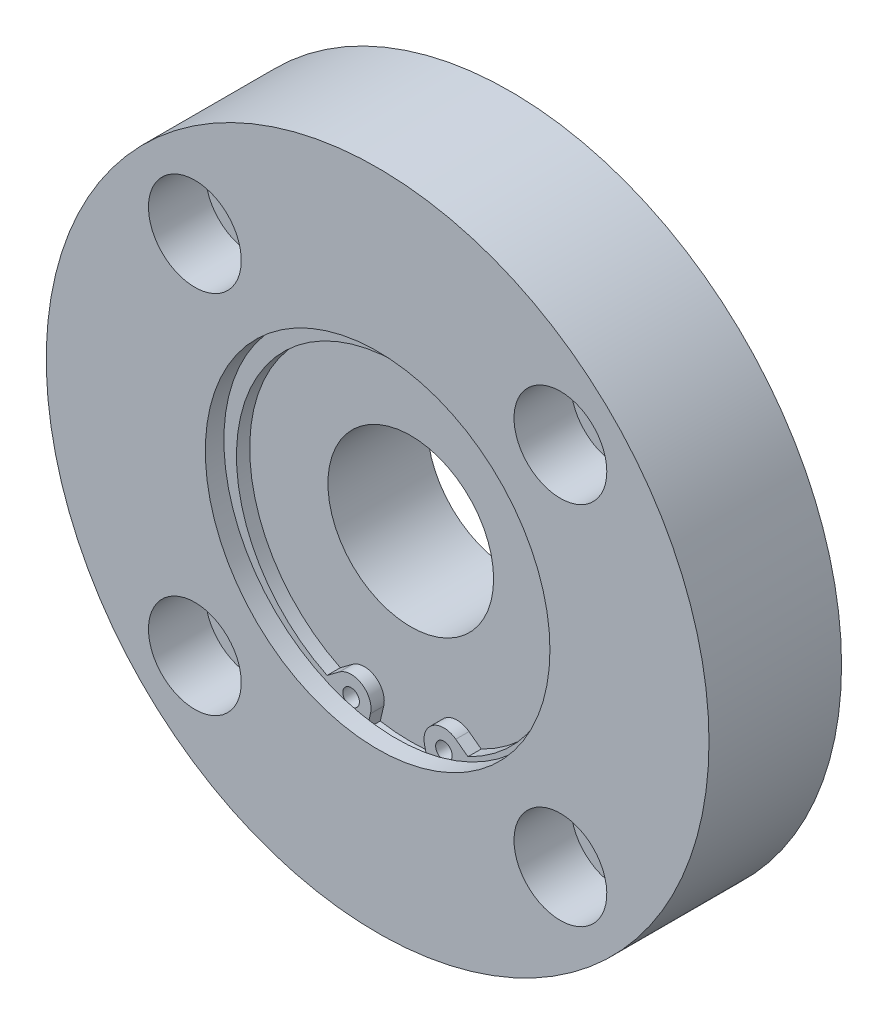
ISO-10303-21;
HEADER;
FILE_DESCRIPTION(('STEP AP214'),'2;1');
FILE_NAME('part.step','',(''),(''),'','','');
FILE_SCHEMA(('AUTOMOTIVE_DESIGN { 1 0 10303 214 1 1 1 1 }'));
ENDSEC;
DATA;
#1=APPLICATION_CONTEXT('core data for automotive mechanical design processes');
#2=APPLICATION_PROTOCOL_DEFINITION('international standard','automotive_design',2000,#1);
#3=PRODUCT_CONTEXT('',#1,'mechanical');
#4=PRODUCT('Part','Part','',(#3));
#5=PRODUCT_RELATED_PRODUCT_CATEGORY('part','',(#4));
#6=PRODUCT_DEFINITION_FORMATION('','',#4);
#7=PRODUCT_DEFINITION_CONTEXT('part definition',#1,'design');
#8=PRODUCT_DEFINITION('design','',#6,#7);
#9=PRODUCT_DEFINITION_SHAPE('','',#8);
#10=(LENGTH_UNIT() NAMED_UNIT(*) SI_UNIT(.MILLI.,.METRE.));
#11=(NAMED_UNIT(*) PLANE_ANGLE_UNIT() SI_UNIT($,.RADIAN.));
#12=(NAMED_UNIT(*) SI_UNIT($,.STERADIAN.) SOLID_ANGLE_UNIT());
#13=UNCERTAINTY_MEASURE_WITH_UNIT(LENGTH_MEASURE(1.E-05),#10,'distance_accuracy_value','');
#14=(GEOMETRIC_REPRESENTATION_CONTEXT(3) GLOBAL_UNCERTAINTY_ASSIGNED_CONTEXT((#13)) GLOBAL_UNIT_ASSIGNED_CONTEXT((#10,
#11,#12)) REPRESENTATION_CONTEXT('',''));
#15=CARTESIAN_POINT('',(0.,0.,0.));
#16=DIRECTION('',(0.,0.,1.));
#17=DIRECTION('',(1.,0.,0.));
#18=AXIS2_PLACEMENT_3D('',#15,#16,#17);
#19=CARTESIAN_POINT('',(0.,0.,15.));
#20=DIRECTION('',(0.,0.,1.));
#21=DIRECTION('',(1.,0.,0.));
#22=AXIS2_PLACEMENT_3D('',#19,#20,#21);
#23=PLANE('',#22);
#24=CARTESIAN_POINT('',(7.,-24.1958547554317,15.));
#25=DIRECTION('',(0.,0.,1.));
#26=DIRECTION('',(1.,0.,0.));
#27=AXIS2_PLACEMENT_3D('',#24,#25,#26);
#28=CIRCLE('',#27,1.25);
#29=CARTESIAN_POINT('',(8.25,-24.1958547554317,15.));
#30=VERTEX_POINT('',#29);
#31=EDGE_CURVE('E136',#30,#30,#28,.T.);
#32=ORIENTED_EDGE('',*,*,#31,.T.);
#33=EDGE_LOOP('',(#32));
#34=FACE_BOUND('',#33,.T.);
#35=ADVANCED_FACE('F14',(#34),#23,.T.);
#36=CARTESIAN_POINT('',(-7.,-24.1958547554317,15.));
#37=DIRECTION('',(0.,0.,-1.));
#38=DIRECTION('',(1.,0.,0.));
#39=AXIS2_PLACEMENT_3D('',#36,#37,#38);
#40=CIRCLE('',#39,1.25);
#41=CARTESIAN_POINT('',(-5.75,-24.1958547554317,15.));
#42=VERTEX_POINT('',#41);
#43=EDGE_CURVE('E162',#42,#42,#40,.T.);
#44=ORIENTED_EDGE('',*,*,#43,.F.);
#45=EDGE_LOOP('',(#44));
#46=FACE_BOUND('',#45,.T.);
#47=ADVANCED_FACE('F275',(#46),#23,.T.);
#48=CARTESIAN_POINT('',(27.5771644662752,27.5771644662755,0.));
#49=DIRECTION('',(0.,0.,1.));
#50=DIRECTION('',(1.,0.,0.));
#51=AXIS2_PLACEMENT_3D('',#48,#49,#50);
#52=CYLINDRICAL_SURFACE('',#51,5.);
#53=CARTESIAN_POINT('',(27.5771644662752,27.5771644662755,0.));
#54=DIRECTION('',(0.,0.,1.));
#55=DIRECTION('',(1.,0.,0.));
#56=AXIS2_PLACEMENT_3D('',#53,#54,#55);
#57=CIRCLE('',#56,5.);
#58=CARTESIAN_POINT('',(32.5771644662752,27.5771644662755,0.));
#59=VERTEX_POINT('',#58);
#60=EDGE_CURVE('E228',#59,#59,#57,.T.);
#61=ORIENTED_EDGE('',*,*,#60,.F.);
#62=EDGE_LOOP('',(#61));
#63=FACE_BOUND('',#62,.T.);
#64=CARTESIAN_POINT('',(27.5771644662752,27.5771644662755,11.4));
#65=DIRECTION('',(0.,0.,1.));
#66=DIRECTION('',(1.,0.,0.));
#67=AXIS2_PLACEMENT_3D('',#64,#65,#66);
#68=CIRCLE('',#67,5.);
#69=CARTESIAN_POINT('',(32.5771644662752,27.5771644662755,11.4));
#70=VERTEX_POINT('',#69);
#71=EDGE_CURVE('E227',#70,#70,#68,.F.);
#72=ORIENTED_EDGE('',*,*,#71,.F.);
#73=EDGE_LOOP('',(#72));
#74=FACE_BOUND('',#73,.T.);
#75=ADVANCED_FACE('F282',(#63,#74),#52,.F.);
#76=CARTESIAN_POINT('',(27.5771644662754,-27.5771644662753,0.));
#77=DIRECTION('',(0.,0.,1.));
#78=DIRECTION('',(1.,0.,0.));
#79=AXIS2_PLACEMENT_3D('',#76,#77,#78);
#80=CYLINDRICAL_SURFACE('',#79,5.);
#81=CARTESIAN_POINT('',(27.5771644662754,-27.5771644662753,0.));
#82=DIRECTION('',(0.,0.,1.));
#83=DIRECTION('',(0.,-1.,0.));
#84=AXIS2_PLACEMENT_3D('',#81,#82,#83);
#85=CIRCLE('',#84,5.);
#86=CARTESIAN_POINT('',(27.5771644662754,-32.5771644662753,0.));
#87=VERTEX_POINT('',#86);
#88=EDGE_CURVE('E218',#87,#87,#85,.T.);
#89=ORIENTED_EDGE('',*,*,#88,.F.);
#90=EDGE_LOOP('',(#89));
#91=FACE_BOUND('',#90,.T.);
#92=CARTESIAN_POINT('',(27.5771644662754,-27.5771644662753,11.4));
#93=DIRECTION('',(0.,0.,1.));
#94=DIRECTION('',(1.,0.,0.));
#95=AXIS2_PLACEMENT_3D('',#92,#93,#94);
#96=CIRCLE('',#95,5.);
#97=CARTESIAN_POINT('',(32.5771644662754,-27.5771644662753,11.4));
#98=VERTEX_POINT('',#97);
#99=EDGE_CURVE('E211',#98,#98,#96,.F.);
#100=ORIENTED_EDGE('',*,*,#99,.F.);
#101=EDGE_LOOP('',(#100));
#102=FACE_BOUND('',#101,.T.);
#103=ADVANCED_FACE('F635',(#91,#102),#80,.F.);
#104=CARTESIAN_POINT('',(-27.5771644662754,-27.5771644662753,0.));
#105=DIRECTION('',(0.,0.,1.));
#106=DIRECTION('',(1.,0.,0.));
#107=AXIS2_PLACEMENT_3D('',#104,#105,#106);
#108=CYLINDRICAL_SURFACE('',#107,5.);
#109=CARTESIAN_POINT('',(-27.5771644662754,-27.5771644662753,0.));
#110=DIRECTION('',(0.,0.,1.));
#111=DIRECTION('',(-1.,0.,0.));
#112=AXIS2_PLACEMENT_3D('',#109,#110,#111);
#113=CIRCLE('',#112,5.);
#114=CARTESIAN_POINT('',(-32.5771644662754,-27.5771644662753,0.));
#115=VERTEX_POINT('',#114);
#116=EDGE_CURVE('E215',#115,#115,#113,.T.);
#117=ORIENTED_EDGE('',*,*,#116,.F.);
#118=EDGE_LOOP('',(#117));
#119=FACE_BOUND('',#118,.T.);
#120=CARTESIAN_POINT('',(-27.5771644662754,-27.5771644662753,11.4));
#121=DIRECTION('',(0.,0.,1.));
#122=DIRECTION('',(1.,0.,0.));
#123=AXIS2_PLACEMENT_3D('',#120,#121,#122);
#124=CIRCLE('',#123,5.);
#125=CARTESIAN_POINT('',(-22.5771644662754,-27.5771644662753,11.4));
#126=VERTEX_POINT('',#125);
#127=EDGE_CURVE('E204',#126,#126,#124,.F.);
#128=ORIENTED_EDGE('',*,*,#127,.F.);
#129=EDGE_LOOP('',(#128));
#130=FACE_BOUND('',#129,.T.);
#131=ADVANCED_FACE('F625',(#119,#130),#108,.F.);
#132=CARTESIAN_POINT('',(-27.5771644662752,27.5771644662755,0.));
#133=DIRECTION('',(0.,0.,1.));
#134=DIRECTION('',(1.,0.,0.));
#135=AXIS2_PLACEMENT_3D('',#132,#133,#134);
#136=CYLINDRICAL_SURFACE('',#135,5.);
#137=CARTESIAN_POINT('',(-27.5771644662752,27.5771644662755,0.));
#138=DIRECTION('',(0.,0.,1.));
#139=DIRECTION('',(0.,1.,0.));
#140=AXIS2_PLACEMENT_3D('',#137,#138,#139);
#141=CIRCLE('',#140,5.);
#142=CARTESIAN_POINT('',(-27.5771644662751,32.5771644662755,0.));
#143=VERTEX_POINT('',#142);
#144=EDGE_CURVE('E212',#143,#143,#141,.T.);
#145=ORIENTED_EDGE('',*,*,#144,.F.);
#146=EDGE_LOOP('',(#145));
#147=FACE_BOUND('',#146,.T.);
#148=CARTESIAN_POINT('',(-27.5771644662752,27.5771644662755,11.4));
#149=DIRECTION('',(0.,0.,1.));
#150=DIRECTION('',(1.,0.,0.));
#151=AXIS2_PLACEMENT_3D('',#148,#149,#150);
#152=CIRCLE('',#151,5.);
#153=CARTESIAN_POINT('',(-22.5771644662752,27.5771644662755,11.4));
#154=VERTEX_POINT('',#153);
#155=EDGE_CURVE('E197',#154,#154,#152,.F.);
#156=ORIENTED_EDGE('',*,*,#155,.F.);
#157=EDGE_LOOP('',(#156));
#158=FACE_BOUND('',#157,.T.);
#159=ADVANCED_FACE('F616',(#147,#158),#136,.F.);
#160=CARTESIAN_POINT('',(0.,0.,0.));
#161=DIRECTION('',(0.,0.,1.));
#162=DIRECTION('',(1.,0.,0.));
#163=AXIS2_PLACEMENT_3D('',#160,#161,#162);
#164=PLANE('',#163);
#165=ORIENTED_EDGE('',*,*,#144,.T.);
#166=EDGE_LOOP('',(#165));
#167=FACE_BOUND('',#166,.T.);
#168=ORIENTED_EDGE('',*,*,#116,.T.);
#169=EDGE_LOOP('',(#168));
#170=FACE_BOUND('',#169,.T.);
#171=ORIENTED_EDGE('',*,*,#88,.T.);
#172=EDGE_LOOP('',(#171));
#173=FACE_BOUND('',#172,.T.);
#174=ORIENTED_EDGE('',*,*,#60,.T.);
#175=EDGE_LOOP('',(#174));
#176=FACE_BOUND('',#175,.T.);
#177=CARTESIAN_POINT('',(0.,0.,0.));
#178=DIRECTION('',(0.,0.,1.));
#179=DIRECTION('',(1.,0.,0.));
#180=AXIS2_PLACEMENT_3D('',#177,#178,#179);
#181=CIRCLE('',#180,50.);
#182=CARTESIAN_POINT('',(50.,0.,0.));
#183=VERTEX_POINT('',#182);
#184=EDGE_CURVE('E234',#183,#183,#181,.T.);
#185=ORIENTED_EDGE('',*,*,#184,.F.);
#186=EDGE_LOOP('',(#185));
#187=FACE_BOUND('',#186,.T.);
#188=CARTESIAN_POINT('',(0.,0.,0.));
#189=DIRECTION('',(0.,0.,-1.));
#190=DIRECTION('',(-1.,0.,0.));
#191=AXIS2_PLACEMENT_3D('',#188,#189,#190);
#192=CIRCLE('',#191,30.);
#193=CARTESIAN_POINT('',(-30.,0.,0.));
#194=VERTEX_POINT('',#193);
#195=EDGE_CURVE('E180',#194,#194,#192,.T.);
#196=ORIENTED_EDGE('',*,*,#195,.F.);
#197=EDGE_LOOP('',(#196));
#198=FACE_BOUND('',#197,.T.);
#199=ADVANCED_FACE('F271',(#167,#170,#173,#176,#187,#198),#164,.F.);
#200=CARTESIAN_POINT('',(27.5771644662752,27.5771644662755,11.4));
#201=DIRECTION('',(0.,0.,1.));
#202=DIRECTION('',(1.,0.,0.));
#203=AXIS2_PLACEMENT_3D('',#200,#201,#202);
#204=PLANE('',#203);
#205=CARTESIAN_POINT('',(27.5771644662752,27.5771644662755,11.4));
#206=DIRECTION('',(0.,0.,1.));
#207=DIRECTION('',(1.,0.,0.));
#208=AXIS2_PLACEMENT_3D('',#205,#206,#207);
#209=CIRCLE('',#208,7.);
#210=CARTESIAN_POINT('',(34.5771644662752,27.5771644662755,11.4));
#211=VERTEX_POINT('',#210);
#212=EDGE_CURVE('E224',#211,#211,#209,.T.);
#213=ORIENTED_EDGE('',*,*,#212,.T.);
#214=EDGE_LOOP('',(#213));
#215=FACE_BOUND('',#214,.T.);
#216=ORIENTED_EDGE('',*,*,#71,.T.);
#217=EDGE_LOOP('',(#216));
#218=FACE_BOUND('',#217,.T.);
#219=ADVANCED_FACE('F597',(#215,#218),#204,.T.);
#220=CARTESIAN_POINT('',(27.5771644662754,-27.5771644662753,11.4));
#221=DIRECTION('',(0.,0.,1.));
#222=DIRECTION('',(0.,-1.,0.));
#223=AXIS2_PLACEMENT_3D('',#220,#221,#222);
#224=PLANE('',#223);
#225=CARTESIAN_POINT('',(27.5771644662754,-27.5771644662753,11.4));
#226=DIRECTION('',(0.,0.,1.));
#227=DIRECTION('',(0.,-1.,0.));
#228=AXIS2_PLACEMENT_3D('',#225,#226,#227);
#229=CIRCLE('',#228,7.);
#230=CARTESIAN_POINT('',(27.5771644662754,-34.5771644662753,11.4));
#231=VERTEX_POINT('',#230);
#232=EDGE_CURVE('E208',#231,#231,#229,.T.);
#233=ORIENTED_EDGE('',*,*,#232,.T.);
#234=EDGE_LOOP('',(#233));
#235=FACE_BOUND('',#234,.T.);
#236=ORIENTED_EDGE('',*,*,#99,.T.);
#237=EDGE_LOOP('',(#236));
#238=FACE_BOUND('',#237,.T.);
#239=ADVANCED_FACE('F587',(#235,#238),#224,.T.);
#240=CARTESIAN_POINT('',(-27.5771644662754,-27.5771644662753,11.4));
#241=DIRECTION('',(0.,0.,1.));
#242=DIRECTION('',(-1.,0.,0.));
#243=AXIS2_PLACEMENT_3D('',#240,#241,#242);
#244=PLANE('',#243);
#245=CARTESIAN_POINT('',(-27.5771644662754,-27.5771644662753,11.4));
#246=DIRECTION('',(0.,0.,1.));
#247=DIRECTION('',(-1.,0.,0.));
#248=AXIS2_PLACEMENT_3D('',#245,#246,#247);
#249=CIRCLE('',#248,7.);
#250=CARTESIAN_POINT('',(-34.5771644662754,-27.5771644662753,11.4));
#251=VERTEX_POINT('',#250);
#252=EDGE_CURVE('E201',#251,#251,#249,.T.);
#253=ORIENTED_EDGE('',*,*,#252,.T.);
#254=EDGE_LOOP('',(#253));
#255=FACE_BOUND('',#254,.T.);
#256=ORIENTED_EDGE('',*,*,#127,.T.);
#257=EDGE_LOOP('',(#256));
#258=FACE_BOUND('',#257,.T.);
#259=ADVANCED_FACE('F577',(#255,#258),#244,.T.);
#260=CARTESIAN_POINT('',(-27.5771644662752,27.5771644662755,11.4));
#261=DIRECTION('',(0.,0.,1.));
#262=DIRECTION('',(0.,1.,0.));
#263=AXIS2_PLACEMENT_3D('',#260,#261,#262);
#264=PLANE('',#263);
#265=CARTESIAN_POINT('',(-27.5771644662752,27.5771644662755,11.4));
#266=DIRECTION('',(0.,0.,1.));
#267=DIRECTION('',(0.,1.,0.));
#268=AXIS2_PLACEMENT_3D('',#265,#266,#267);
#269=CIRCLE('',#268,7.);
#270=CARTESIAN_POINT('',(-27.5771644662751,34.5771644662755,11.4));
#271=VERTEX_POINT('',#270);
#272=EDGE_CURVE('E194',#271,#271,#269,.T.);
#273=ORIENTED_EDGE('',*,*,#272,.T.);
#274=EDGE_LOOP('',(#273));
#275=FACE_BOUND('',#274,.T.);
#276=ORIENTED_EDGE('',*,*,#155,.T.);
#277=EDGE_LOOP('',(#276));
#278=FACE_BOUND('',#277,.T.);
#279=ADVANCED_FACE('F568',(#275,#278),#264,.T.);
#280=CARTESIAN_POINT('',(0.,0.,-5.));
#281=DIRECTION('',(0.,0.,1.));
#282=DIRECTION('',(1.,0.,0.));
#283=AXIS2_PLACEMENT_3D('',#280,#281,#282);
#284=CYLINDRICAL_SURFACE('',#283,30.);
#285=CARTESIAN_POINT('',(0.,0.,-5.));
#286=DIRECTION('',(0.,0.,-1.));
#287=DIRECTION('',(-1.,0.,0.));
#288=AXIS2_PLACEMENT_3D('',#285,#286,#287);
#289=CIRCLE('',#288,30.);
#290=CARTESIAN_POINT('',(-30.,0.,-5.));
#291=VERTEX_POINT('',#290);
#292=EDGE_CURVE('E179',#291,#291,#289,.T.);
#293=ORIENTED_EDGE('',*,*,#292,.F.);
#294=EDGE_LOOP('',(#293));
#295=FACE_BOUND('',#294,.T.);
#296=ORIENTED_EDGE('',*,*,#195,.T.);
#297=EDGE_LOOP('',(#296));
#298=FACE_BOUND('',#297,.T.);
#299=ADVANCED_FACE('F559',(#295,#298),#284,.T.);
#300=CARTESIAN_POINT('',(0.,0.,20.));
#301=DIRECTION('',(0.,0.,-1.));
#302=DIRECTION('',(-1.,0.,0.));
#303=AXIS2_PLACEMENT_3D('',#300,#301,#302);
#304=CYLINDRICAL_SURFACE('',#303,50.);
#305=CARTESIAN_POINT('',(0.,0.,20.));
#306=DIRECTION('',(0.,0.,1.));
#307=DIRECTION('',(1.,0.,0.));
#308=AXIS2_PLACEMENT_3D('',#305,#306,#307);
#309=CIRCLE('',#308,50.);
#310=CARTESIAN_POINT('',(50.,0.,20.));
#311=VERTEX_POINT('',#310);
#312=EDGE_CURVE('E184',#311,#311,#309,.T.);
#313=ORIENTED_EDGE('',*,*,#312,.F.);
#314=EDGE_LOOP('',(#313));
#315=FACE_BOUND('',#314,.T.);
#316=ORIENTED_EDGE('',*,*,#184,.T.);
#317=EDGE_LOOP('',(#316));
#318=FACE_BOUND('',#317,.T.);
#319=ADVANCED_FACE('F16',(#315,#318),#304,.T.);
#320=CARTESIAN_POINT('',(27.5771644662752,27.5771644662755,11.4));
#321=DIRECTION('',(0.,0.,1.));
#322=DIRECTION('',(1.,0.,0.));
#323=AXIS2_PLACEMENT_3D('',#320,#321,#322);
#324=CYLINDRICAL_SURFACE('',#323,7.);
#325=ORIENTED_EDGE('',*,*,#212,.F.);
#326=EDGE_LOOP('',(#325));
#327=FACE_BOUND('',#326,.T.);
#328=CARTESIAN_POINT('',(27.5771644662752,27.5771644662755,20.));
#329=DIRECTION('',(0.,0.,1.));
#330=DIRECTION('',(1.,0.,0.));
#331=AXIS2_PLACEMENT_3D('',#328,#329,#330);
#332=CIRCLE('',#331,7.);
#333=CARTESIAN_POINT('',(34.5771644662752,27.5771644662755,20.));
#334=VERTEX_POINT('',#333);
#335=EDGE_CURVE('E221',#334,#334,#332,.T.);
#336=ORIENTED_EDGE('',*,*,#335,.T.);
#337=EDGE_LOOP('',(#336));
#338=FACE_BOUND('',#337,.T.);
#339=ADVANCED_FACE('F540',(#327,#338),#324,.F.);
#340=CARTESIAN_POINT('',(27.5771644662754,-27.5771644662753,11.4));
#341=DIRECTION('',(0.,0.,1.));
#342=DIRECTION('',(1.,0.,0.));
#343=AXIS2_PLACEMENT_3D('',#340,#341,#342);
#344=CYLINDRICAL_SURFACE('',#343,7.);
#345=ORIENTED_EDGE('',*,*,#232,.F.);
#346=EDGE_LOOP('',(#345));
#347=FACE_BOUND('',#346,.T.);
#348=CARTESIAN_POINT('',(27.5771644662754,-27.5771644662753,20.));
#349=DIRECTION('',(0.,0.,1.));
#350=DIRECTION('',(0.,-1.,0.));
#351=AXIS2_PLACEMENT_3D('',#348,#349,#350);
#352=CIRCLE('',#351,7.);
#353=CARTESIAN_POINT('',(27.5771644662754,-34.5771644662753,20.));
#354=VERTEX_POINT('',#353);
#355=EDGE_CURVE('E205',#354,#354,#352,.T.);
#356=ORIENTED_EDGE('',*,*,#355,.T.);
#357=EDGE_LOOP('',(#356));
#358=FACE_BOUND('',#357,.T.);
#359=ADVANCED_FACE('F530',(#347,#358),#344,.F.);
#360=CARTESIAN_POINT('',(-27.5771644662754,-27.5771644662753,11.4));
#361=DIRECTION('',(0.,0.,1.));
#362=DIRECTION('',(1.,0.,0.));
#363=AXIS2_PLACEMENT_3D('',#360,#361,#362);
#364=CYLINDRICAL_SURFACE('',#363,7.);
#365=ORIENTED_EDGE('',*,*,#252,.F.);
#366=EDGE_LOOP('',(#365));
#367=FACE_BOUND('',#366,.T.);
#368=CARTESIAN_POINT('',(-27.5771644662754,-27.5771644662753,20.));
#369=DIRECTION('',(0.,0.,1.));
#370=DIRECTION('',(-1.,0.,0.));
#371=AXIS2_PLACEMENT_3D('',#368,#369,#370);
#372=CIRCLE('',#371,7.);
#373=CARTESIAN_POINT('',(-34.5771644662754,-27.5771644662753,20.));
#374=VERTEX_POINT('',#373);
#375=EDGE_CURVE('E198',#374,#374,#372,.T.);
#376=ORIENTED_EDGE('',*,*,#375,.T.);
#377=EDGE_LOOP('',(#376));
#378=FACE_BOUND('',#377,.T.);
#379=ADVANCED_FACE('F520',(#367,#378),#364,.F.);
#380=CARTESIAN_POINT('',(-27.5771644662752,27.5771644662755,11.4));
#381=DIRECTION('',(0.,0.,1.));
#382=DIRECTION('',(1.,0.,0.));
#383=AXIS2_PLACEMENT_3D('',#380,#381,#382);
#384=CYLINDRICAL_SURFACE('',#383,7.);
#385=ORIENTED_EDGE('',*,*,#272,.F.);
#386=EDGE_LOOP('',(#385));
#387=FACE_BOUND('',#386,.T.);
#388=CARTESIAN_POINT('',(-27.5771644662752,27.5771644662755,20.));
#389=DIRECTION('',(0.,0.,1.));
#390=DIRECTION('',(0.,1.,0.));
#391=AXIS2_PLACEMENT_3D('',#388,#389,#390);
#392=CIRCLE('',#391,7.);
#393=CARTESIAN_POINT('',(-27.5771644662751,34.5771644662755,20.));
#394=VERTEX_POINT('',#393);
#395=EDGE_CURVE('E191',#394,#394,#392,.T.);
#396=ORIENTED_EDGE('',*,*,#395,.T.);
#397=EDGE_LOOP('',(#396));
#398=FACE_BOUND('',#397,.T.);
#399=ADVANCED_FACE('F510',(#387,#398),#384,.F.);
#400=CARTESIAN_POINT('',(0.,0.,-5.));
#401=DIRECTION('',(0.,0.,-1.));
#402=DIRECTION('',(-1.,0.,0.));
#403=AXIS2_PLACEMENT_3D('',#400,#401,#402);
#404=PLANE('',#403);
#405=ORIENTED_EDGE('',*,*,#292,.T.);
#406=EDGE_LOOP('',(#405));
#407=FACE_BOUND('',#406,.T.);
#408=CARTESIAN_POINT('',(0.,0.,-5.));
#409=DIRECTION('',(0.,0.,-1.));
#410=DIRECTION('',(-1.,0.,0.));
#411=AXIS2_PLACEMENT_3D('',#408,#409,#410);
#412=CIRCLE('',#411,22.5);
#413=CARTESIAN_POINT('',(-22.5,0.,-5.));
#414=VERTEX_POINT('',#413);
#415=EDGE_CURVE('E176',#414,#414,#412,.T.);
#416=ORIENTED_EDGE('',*,*,#415,.F.);
#417=EDGE_LOOP('',(#416));
#418=FACE_BOUND('',#417,.T.);
#419=ADVANCED_FACE('F501',(#407,#418),#404,.T.);
#420=CARTESIAN_POINT('',(0.,0.,20.));
#421=DIRECTION('',(0.,0.,1.));
#422=DIRECTION('',(1.,0.,0.));
#423=AXIS2_PLACEMENT_3D('',#420,#421,#422);
#424=PLANE('',#423);
#425=CARTESIAN_POINT('',(0.,0.,20.));
#426=DIRECTION('',(0.,0.,1.));
#427=DIRECTION('',(1.,0.,0.));
#428=AXIS2_PLACEMENT_3D('',#425,#426,#427);
#429=CIRCLE('',#428,26.);
#430=CARTESIAN_POINT('',(26.,0.,20.));
#431=VERTEX_POINT('',#430);
#432=EDGE_CURVE('E187',#431,#431,#429,.T.);
#433=ORIENTED_EDGE('',*,*,#432,.F.);
#434=EDGE_LOOP('',(#433));
#435=FACE_BOUND('',#434,.T.);
#436=ORIENTED_EDGE('',*,*,#395,.F.);
#437=EDGE_LOOP('',(#436));
#438=FACE_BOUND('',#437,.T.);
#439=ORIENTED_EDGE('',*,*,#375,.F.);
#440=EDGE_LOOP('',(#439));
#441=FACE_BOUND('',#440,.T.);
#442=ORIENTED_EDGE('',*,*,#355,.F.);
#443=EDGE_LOOP('',(#442));
#444=FACE_BOUND('',#443,.T.);
#445=ORIENTED_EDGE('',*,*,#335,.F.);
#446=EDGE_LOOP('',(#445));
#447=FACE_BOUND('',#446,.T.);
#448=ORIENTED_EDGE('',*,*,#312,.T.);
#449=EDGE_LOOP('',(#448));
#450=FACE_BOUND('',#449,.T.);
#451=ADVANCED_FACE('F491',(#435,#438,#441,#444,#447,#450),#424,.T.);
#452=CARTESIAN_POINT('',(0.,0.,-5.));
#453=DIRECTION('',(0.,0.,1.));
#454=DIRECTION('',(1.,0.,0.));
#455=AXIS2_PLACEMENT_3D('',#452,#453,#454);
#456=CYLINDRICAL_SURFACE('',#455,22.5);
#457=ORIENTED_EDGE('',*,*,#415,.T.);
#458=EDGE_LOOP('',(#457));
#459=FACE_BOUND('',#458,.T.);
#460=CARTESIAN_POINT('',(0.,0.,0.));
#461=DIRECTION('',(0.,0.,-1.));
#462=DIRECTION('',(-1.,0.,0.));
#463=AXIS2_PLACEMENT_3D('',#460,#461,#462);
#464=CIRCLE('',#463,22.5);
#465=CARTESIAN_POINT('',(-22.5,0.,0.));
#466=VERTEX_POINT('',#465);
#467=EDGE_CURVE('E173',#466,#466,#464,.T.);
#468=ORIENTED_EDGE('',*,*,#467,.F.);
#469=EDGE_LOOP('',(#468));
#470=FACE_BOUND('',#469,.T.);
#471=ADVANCED_FACE('F483',(#459,#470),#456,.F.);
#472=CARTESIAN_POINT('',(0.,0.,15.));
#473=DIRECTION('',(0.,0.,1.));
#474=DIRECTION('',(1.,0.,0.));
#475=AXIS2_PLACEMENT_3D('',#472,#473,#474);
#476=CYLINDRICAL_SURFACE('',#475,26.);
#477=CARTESIAN_POINT('',(0.,0.,17.2));
#478=DIRECTION('',(0.,0.,1.));
#479=DIRECTION('',(1.,0.,0.));
#480=AXIS2_PLACEMENT_3D('',#477,#478,#479);
#481=CIRCLE('',#480,26.);
#482=CARTESIAN_POINT('',(26.,0.,17.2));
#483=VERTEX_POINT('',#482);
#484=EDGE_CURVE('E169',#483,#483,#481,.F.);
#485=ORIENTED_EDGE('',*,*,#484,.T.);
#486=EDGE_LOOP('',(#485));
#487=FACE_BOUND('',#486,.T.);
#488=ORIENTED_EDGE('',*,*,#432,.T.);
#489=EDGE_LOOP('',(#488));
#490=FACE_BOUND('',#489,.T.);
#491=ADVANCED_FACE('F252',(#487,#490),#476,.F.);
#492=ORIENTED_EDGE('',*,*,#467,.T.);
#493=EDGE_LOOP('',(#492));
#494=FACE_BOUND('',#493,.T.);
#495=CARTESIAN_POINT('',(0.,0.,0.));
#496=DIRECTION('',(0.,0.,1.));
#497=DIRECTION('',(1.,0.,0.));
#498=AXIS2_PLACEMENT_3D('',#495,#496,#497);
#499=CIRCLE('',#498,12.5);
#500=CARTESIAN_POINT('',(12.5,0.,0.));
#501=VERTEX_POINT('',#500);
#502=EDGE_CURVE('E231',#501,#501,#499,.T.);
#503=ORIENTED_EDGE('',*,*,#502,.T.);
#504=EDGE_LOOP('',(#503));
#505=FACE_BOUND('',#504,.T.);
#506=ADVANCED_FACE('F258',(#494,#505),#164,.F.);
#507=CARTESIAN_POINT('',(0.,0.,17.2));
#508=DIRECTION('',(0.,0.,1.));
#509=DIRECTION('',(1.,0.,0.));
#510=AXIS2_PLACEMENT_3D('',#507,#508,#509);
#511=PLANE('',#510);
#512=CARTESIAN_POINT('',(0.,0.,17.2));
#513=DIRECTION('',(0.,0.,1.));
#514=DIRECTION('',(1.,0.,0.));
#515=AXIS2_PLACEMENT_3D('',#512,#513,#514);
#516=CIRCLE('',#515,27.5);
#517=CARTESIAN_POINT('',(27.5,0.,17.2));
#518=VERTEX_POINT('',#517);
#519=EDGE_CURVE('E166',#518,#518,#516,.T.);
#520=ORIENTED_EDGE('',*,*,#519,.F.);
#521=EDGE_LOOP('',(#520));
#522=FACE_BOUND('',#521,.T.);
#523=ORIENTED_EDGE('',*,*,#484,.F.);
#524=EDGE_LOOP('',(#523));
#525=FACE_BOUND('',#524,.T.);
#526=ADVANCED_FACE('F255',(#522,#525),#511,.F.);
#527=CARTESIAN_POINT('',(0.,0.,17.2));
#528=DIRECTION('',(0.,0.,-1.));
#529=DIRECTION('',(-1.,0.,0.));
#530=AXIS2_PLACEMENT_3D('',#527,#528,#529);
#531=CYLINDRICAL_SURFACE('',#530,27.5);
#532=ORIENTED_EDGE('',*,*,#519,.T.);
#533=EDGE_LOOP('',(#532));
#534=FACE_BOUND('',#533,.T.);
#535=DIRECTION('',(0.,0.,-1.));
#536=VECTOR('',#535,1.);
#537=CARTESIAN_POINT('',(4.60954752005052,-27.1109216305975,17.2));
#538=LINE('',#537,#536);
#539=CARTESIAN_POINT('',(4.60954752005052,-27.1109216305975,15.));
#540=VERTEX_POINT('',#539);
#541=CARTESIAN_POINT('',(4.60954752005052,-27.1109216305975,17.));
#542=VERTEX_POINT('',#541);
#543=EDGE_CURVE('E18',#540,#542,#538,.F.);
#544=ORIENTED_EDGE('',*,*,#543,.F.);
#545=CARTESIAN_POINT('',(0.,0.,15.));
#546=DIRECTION('',(0.,0.,1.));
#547=DIRECTION('',(1.,0.,0.));
#548=AXIS2_PLACEMENT_3D('',#545,#546,#547);
#549=CIRCLE('',#548,27.5);
#550=CARTESIAN_POINT('',(-4.60954752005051,-27.1109216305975,15.));
#551=VERTEX_POINT('',#550);
#552=EDGE_CURVE('E170',#551,#540,#549,.T.);
#553=ORIENTED_EDGE('',*,*,#552,.F.);
#554=DIRECTION('',(0.,0.,-1.));
#555=VECTOR('',#554,1.);
#556=CARTESIAN_POINT('',(-4.60954752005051,-27.1109216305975,17.2));
#557=LINE('',#556,#555);
#558=CARTESIAN_POINT('',(-4.60954752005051,-27.1109216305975,17.));
#559=VERTEX_POINT('',#558);
#560=EDGE_CURVE('E163',#559,#551,#557,.T.);
#561=ORIENTED_EDGE('',*,*,#560,.F.);
#562=CARTESIAN_POINT('',(0.,0.,17.));
#563=DIRECTION('',(0.,0.,-1.));
#564=DIRECTION('',(-1.,0.,0.));
#565=AXIS2_PLACEMENT_3D('',#562,#563,#564);
#566=CIRCLE('',#565,27.5);
#567=EDGE_CURVE('E9',#542,#559,#566,.F.);
#568=ORIENTED_EDGE('',*,*,#567,.F.);
#569=EDGE_LOOP('',(#544,#553,#561,#568));
#570=FACE_BOUND('',#569,.T.);
#571=ADVANCED_FACE('F257',(#534,#570),#531,.F.);
#572=CARTESIAN_POINT('',(0.,0.,20.));
#573=DIRECTION('',(0.,0.,-1.));
#574=DIRECTION('',(-1.,0.,0.));
#575=AXIS2_PLACEMENT_3D('',#572,#573,#574);
#576=CYLINDRICAL_SURFACE('',#575,12.5);
#577=ORIENTED_EDGE('',*,*,#502,.F.);
#578=EDGE_LOOP('',(#577));
#579=FACE_BOUND('',#578,.T.);
#580=CARTESIAN_POINT('',(0.,0.,15.));
#581=DIRECTION('',(0.,0.,1.));
#582=DIRECTION('',(1.,0.,0.));
#583=AXIS2_PLACEMENT_3D('',#580,#581,#582);
#584=CIRCLE('',#583,12.5);
#585=CARTESIAN_POINT('',(12.5,0.,15.));
#586=VERTEX_POINT('',#585);
#587=EDGE_CURVE('E190',#586,#586,#584,.T.);
#588=ORIENTED_EDGE('',*,*,#587,.T.);
#589=EDGE_LOOP('',(#588));
#590=FACE_BOUND('',#589,.T.);
#591=ADVANCED_FACE('F266',(#579,#590),#576,.F.);
#592=ORIENTED_EDGE('',*,*,#587,.F.);
#593=EDGE_LOOP('',(#592));
#594=FACE_BOUND('',#593,.T.);
#595=DIRECTION('',(0.231349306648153,-0.972870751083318,0.));
#596=VECTOR('',#595,1.);
#597=CARTESIAN_POINT('',(4.08138774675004,-24.8899026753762,15.));
#598=LINE('',#597,#596);
#599=CARTESIAN_POINT('',(4.08138774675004,-24.8899026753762,15.));
#600=VERTEX_POINT('',#599);
#601=EDGE_CURVE('E34',#600,#540,#598,.T.);
#602=ORIENTED_EDGE('',*,*,#601,.F.);
#603=CARTESIAN_POINT('',(7.,-24.1958547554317,15.));
#604=DIRECTION('',(0.,0.,1.));
#605=DIRECTION('',(1.,0.,0.));
#606=AXIS2_PLACEMENT_3D('',#603,#604,#605);
#607=CIRCLE('',#606,3.);
#608=CARTESIAN_POINT('',(8.7896612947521,-21.7881354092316,15.));
#609=VERTEX_POINT('',#608);
#610=EDGE_CURVE('E148',#609,#600,#607,.T.);
#611=ORIENTED_EDGE('',*,*,#610,.F.);
#612=DIRECTION('',(-0.802573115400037,0.596553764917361,0.));
#613=VECTOR('',#612,1.);
#614=CARTESIAN_POINT('',(8.7896612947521,-21.7881354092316,15.));
#615=LINE('',#614,#613);
#616=CARTESIAN_POINT('',(10.6263840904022,-23.1533741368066,15.));
#617=VERTEX_POINT('',#616);
#618=EDGE_CURVE('E116',#617,#609,#615,.T.);
#619=ORIENTED_EDGE('',*,*,#618,.F.);
#620=CARTESIAN_POINT('',(0.,-1.3,15.));
#621=DIRECTION('',(0.,0.,-1.));
#622=DIRECTION('',(0.,-1.,0.));
#623=AXIS2_PLACEMENT_3D('',#620,#621,#622);
#624=CIRCLE('',#623,24.3);
#625=CARTESIAN_POINT('',(-10.6263840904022,-23.1533741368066,15.));
#626=VERTEX_POINT('',#625);
#627=EDGE_CURVE('E112',#626,#617,#624,.T.);
#628=ORIENTED_EDGE('',*,*,#627,.F.);
#629=DIRECTION('',(-0.802573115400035,-0.596553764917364,0.));
#630=VECTOR('',#629,1.);
#631=CARTESIAN_POINT('',(-8.7896612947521,-21.7881354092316,15.));
#632=LINE('',#631,#630);
#633=CARTESIAN_POINT('',(-8.7896612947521,-21.7881354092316,15.));
#634=VERTEX_POINT('',#633);
#635=EDGE_CURVE('E147',#634,#626,#632,.T.);
#636=ORIENTED_EDGE('',*,*,#635,.F.);
#637=CARTESIAN_POINT('',(-7.,-24.1958547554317,15.));
#638=DIRECTION('',(0.,0.,1.));
#639=DIRECTION('',(-1.,0.,0.));
#640=AXIS2_PLACEMENT_3D('',#637,#638,#639);
#641=CIRCLE('',#640,3.);
#642=CARTESIAN_POINT('',(-4.08138774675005,-24.8899026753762,15.));
#643=VERTEX_POINT('',#642);
#644=EDGE_CURVE('E142',#643,#634,#641,.T.);
#645=ORIENTED_EDGE('',*,*,#644,.F.);
#646=DIRECTION('',(0.231349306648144,0.97287075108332,0.));
#647=VECTOR('',#646,1.);
#648=CARTESIAN_POINT('',(-4.08138774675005,-24.8899026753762,15.));
#649=LINE('',#648,#647);
#650=EDGE_CURVE('E138',#551,#643,#649,.T.);
#651=ORIENTED_EDGE('',*,*,#650,.F.);
#652=ORIENTED_EDGE('',*,*,#552,.T.);
#653=EDGE_LOOP('',(#602,#611,#619,#628,#636,#645,#651,#652));
#654=FACE_BOUND('',#653,.T.);
#655=ADVANCED_FACE('F278',(#594,#654),#23,.T.);
#656=CARTESIAN_POINT('',(0.,-1.3,17.));
#657=DIRECTION('',(0.,0.,1.));
#658=DIRECTION('',(-1.,0.,0.));
#659=AXIS2_PLACEMENT_3D('',#656,#657,#658);
#660=CYLINDRICAL_SURFACE('',#659,24.3);
#661=ORIENTED_EDGE('',*,*,#627,.T.);
#662=DIRECTION('',(0.,0.,-1.));
#663=VECTOR('',#662,1.);
#664=CARTESIAN_POINT('',(10.6263840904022,-23.1533741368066,17.));
#665=LINE('',#664,#663);
#666=CARTESIAN_POINT('',(10.6263840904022,-23.1533741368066,17.));
#667=VERTEX_POINT('',#666);
#668=EDGE_CURVE('E109',#667,#617,#665,.T.);
#669=ORIENTED_EDGE('',*,*,#668,.F.);
#670=CARTESIAN_POINT('',(0.,-1.3,17.));
#671=DIRECTION('',(0.,0.,-1.));
#672=DIRECTION('',(0.,-1.,0.));
#673=AXIS2_PLACEMENT_3D('',#670,#671,#672);
#674=CIRCLE('',#673,24.3);
#675=CARTESIAN_POINT('',(-10.6263840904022,-23.1533741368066,17.));
#676=VERTEX_POINT('',#675);
#677=EDGE_CURVE('E93',#676,#667,#674,.T.);
#678=ORIENTED_EDGE('',*,*,#677,.F.);
#679=DIRECTION('',(0.,0.,-1.));
#680=VECTOR('',#679,1.);
#681=CARTESIAN_POINT('',(-10.6263840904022,-23.1533741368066,17.));
#682=LINE('',#681,#680);
#683=EDGE_CURVE('E137',#676,#626,#682,.T.);
#684=ORIENTED_EDGE('',*,*,#683,.T.);
#685=EDGE_LOOP('',(#661,#669,#678,#684));
#686=FACE_BOUND('',#685,.T.);
#687=ADVANCED_FACE('F110',(#686),#660,.F.);
#688=CARTESIAN_POINT('',(8.7896612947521,-21.7881354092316,17.));
#689=DIRECTION('',(-0.596553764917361,-0.802573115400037,0.));
#690=DIRECTION('',(-0.802573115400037,0.596553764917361,0.));
#691=AXIS2_PLACEMENT_3D('',#688,#689,#690);
#692=PLANE('',#691);
#693=ORIENTED_EDGE('',*,*,#618,.T.);
#694=DIRECTION('',(0.,0.,-1.));
#695=VECTOR('',#694,1.);
#696=CARTESIAN_POINT('',(8.7896612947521,-21.7881354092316,17.));
#697=LINE('',#696,#695);
#698=CARTESIAN_POINT('',(8.7896612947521,-21.7881354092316,17.));
#699=VERTEX_POINT('',#698);
#700=EDGE_CURVE('E120',#699,#609,#697,.T.);
#701=ORIENTED_EDGE('',*,*,#700,.F.);
#702=DIRECTION('',(-0.802573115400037,0.596553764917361,0.));
#703=VECTOR('',#702,1.);
#704=CARTESIAN_POINT('',(8.7896612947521,-21.7881354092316,17.));
#705=LINE('',#704,#703);
#706=EDGE_CURVE('E99',#667,#699,#705,.T.);
#707=ORIENTED_EDGE('',*,*,#706,.F.);
#708=ORIENTED_EDGE('',*,*,#668,.T.);
#709=EDGE_LOOP('',(#693,#701,#707,#708));
#710=FACE_BOUND('',#709,.T.);
#711=ADVANCED_FACE('F118',(#710),#692,.F.);
#712=CARTESIAN_POINT('',(7.,-24.1958547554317,17.));
#713=DIRECTION('',(0.,0.,1.));
#714=DIRECTION('',(-1.,0.,0.));
#715=AXIS2_PLACEMENT_3D('',#712,#713,#714);
#716=CYLINDRICAL_SURFACE('',#715,3.);
#717=ORIENTED_EDGE('',*,*,#610,.T.);
#718=DIRECTION('',(0.,0.,-1.));
#719=VECTOR('',#718,1.);
#720=CARTESIAN_POINT('',(4.08138774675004,-24.8899026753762,17.));
#721=LINE('',#720,#719);
#722=CARTESIAN_POINT('',(4.08138774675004,-24.8899026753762,17.));
#723=VERTEX_POINT('',#722);
#724=EDGE_CURVE('E141',#723,#600,#721,.T.);
#725=ORIENTED_EDGE('',*,*,#724,.F.);
#726=CARTESIAN_POINT('',(7.,-24.1958547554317,17.));
#727=DIRECTION('',(0.,0.,1.));
#728=DIRECTION('',(1.,0.,0.));
#729=AXIS2_PLACEMENT_3D('',#726,#727,#728);
#730=CIRCLE('',#729,3.);
#731=EDGE_CURVE('E122',#699,#723,#730,.T.);
#732=ORIENTED_EDGE('',*,*,#731,.F.);
#733=ORIENTED_EDGE('',*,*,#700,.T.);
#734=EDGE_LOOP('',(#717,#725,#732,#733));
#735=FACE_BOUND('',#734,.T.);
#736=ADVANCED_FACE('F295',(#735),#716,.T.);
#737=CARTESIAN_POINT('',(-4.08138774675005,-24.8899026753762,17.));
#738=DIRECTION('',(-0.97287075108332,0.231349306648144,0.));
#739=DIRECTION('',(0.,0.,1.));
#740=AXIS2_PLACEMENT_3D('',#737,#738,#739);
#741=PLANE('',#740);
#742=DIRECTION('',(0.231349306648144,0.97287075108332,0.));
#743=VECTOR('',#742,1.);
#744=CARTESIAN_POINT('',(-4.08138774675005,-24.8899026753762,17.));
#745=LINE('',#744,#743);
#746=CARTESIAN_POINT('',(-4.08138774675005,-24.8899026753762,17.));
#747=VERTEX_POINT('',#746);
#748=EDGE_CURVE('E131',#559,#747,#745,.T.);
#749=ORIENTED_EDGE('',*,*,#748,.F.);
#750=ORIENTED_EDGE('',*,*,#560,.T.);
#751=ORIENTED_EDGE('',*,*,#650,.T.);
#752=DIRECTION('',(0.,0.,-1.));
#753=VECTOR('',#752,1.);
#754=CARTESIAN_POINT('',(-4.08138774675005,-24.8899026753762,17.));
#755=LINE('',#754,#753);
#756=EDGE_CURVE('E158',#747,#643,#755,.T.);
#757=ORIENTED_EDGE('',*,*,#756,.F.);
#758=EDGE_LOOP('',(#749,#750,#751,#757));
#759=FACE_BOUND('',#758,.T.);
#760=ADVANCED_FACE('F302',(#759),#741,.F.);
#761=CARTESIAN_POINT('',(0.,-1.3,17.));
#762=DIRECTION('',(0.,0.,-1.));
#763=DIRECTION('',(0.,-1.,0.));
#764=AXIS2_PLACEMENT_3D('',#761,#762,#763);
#765=PLANE('',#764);
#766=CARTESIAN_POINT('',(-7.,-24.1958547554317,17.));
#767=DIRECTION('',(0.,0.,-1.));
#768=DIRECTION('',(1.,0.,0.));
#769=AXIS2_PLACEMENT_3D('',#766,#767,#768);
#770=CIRCLE('',#769,1.25);
#771=CARTESIAN_POINT('',(-5.75,-24.1958547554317,17.));
#772=VERTEX_POINT('',#771);
#773=EDGE_CURVE('E151',#772,#772,#770,.T.);
#774=ORIENTED_EDGE('',*,*,#773,.T.);
#775=EDGE_LOOP('',(#774));
#776=FACE_BOUND('',#775,.T.);
#777=CARTESIAN_POINT('',(7.,-24.1958547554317,17.));
#778=DIRECTION('',(0.,0.,1.));
#779=DIRECTION('',(1.,0.,0.));
#780=AXIS2_PLACEMENT_3D('',#777,#778,#779);
#781=CIRCLE('',#780,1.25);
#782=CARTESIAN_POINT('',(8.25,-24.1958547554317,17.));
#783=VERTEX_POINT('',#782);
#784=EDGE_CURVE('E183',#783,#783,#781,.T.);
#785=ORIENTED_EDGE('',*,*,#784,.F.);
#786=EDGE_LOOP('',(#785));
#787=FACE_BOUND('',#786,.T.);
#788=DIRECTION('',(0.231349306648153,-0.972870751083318,0.));
#789=VECTOR('',#788,1.);
#790=CARTESIAN_POINT('',(4.08138774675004,-24.8899026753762,17.));
#791=LINE('',#790,#789);
#792=EDGE_CURVE('E127',#723,#542,#791,.T.);
#793=ORIENTED_EDGE('',*,*,#792,.T.);
#794=ORIENTED_EDGE('',*,*,#567,.T.);
#795=ORIENTED_EDGE('',*,*,#748,.T.);
#796=CARTESIAN_POINT('',(-7.,-24.1958547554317,17.));
#797=DIRECTION('',(0.,0.,1.));
#798=DIRECTION('',(-1.,0.,0.));
#799=AXIS2_PLACEMENT_3D('',#796,#797,#798);
#800=CIRCLE('',#799,3.);
#801=CARTESIAN_POINT('',(-8.7896612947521,-21.7881354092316,17.));
#802=VERTEX_POINT('',#801);
#803=EDGE_CURVE('E134',#747,#802,#800,.T.);
#804=ORIENTED_EDGE('',*,*,#803,.T.);
#805=DIRECTION('',(-0.802573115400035,-0.596553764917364,0.));
#806=VECTOR('',#805,1.);
#807=CARTESIAN_POINT('',(-8.7896612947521,-21.7881354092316,17.));
#808=LINE('',#807,#806);
#809=EDGE_CURVE('E102',#802,#676,#808,.T.);
#810=ORIENTED_EDGE('',*,*,#809,.T.);
#811=ORIENTED_EDGE('',*,*,#677,.T.);
#812=ORIENTED_EDGE('',*,*,#706,.T.);
#813=ORIENTED_EDGE('',*,*,#731,.T.);
#814=EDGE_LOOP('',(#793,#794,#795,#804,#810,#811,#812,#813));
#815=FACE_BOUND('',#814,.T.);
#816=ADVANCED_FACE('F96',(#776,#787,#815),#765,.F.);
#817=CARTESIAN_POINT('',(7.,-24.1958547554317,17.));
#818=DIRECTION('',(0.,0.,1.));
#819=DIRECTION('',(-1.,0.,0.));
#820=AXIS2_PLACEMENT_3D('',#817,#818,#819);
#821=CYLINDRICAL_SURFACE('',#820,1.25);
#822=ORIENTED_EDGE('',*,*,#31,.F.);
#823=EDGE_LOOP('',(#822));
#824=FACE_BOUND('',#823,.T.);
#825=ORIENTED_EDGE('',*,*,#784,.T.);
#826=EDGE_LOOP('',(#825));
#827=FACE_BOUND('',#826,.T.);
#828=ADVANCED_FACE('F301',(#824,#827),#821,.F.);
#829=CARTESIAN_POINT('',(-7.,-24.1958547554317,17.));
#830=DIRECTION('',(0.,0.,1.));
#831=DIRECTION('',(-1.,0.,0.));
#832=AXIS2_PLACEMENT_3D('',#829,#830,#831);
#833=CYLINDRICAL_SURFACE('',#832,1.25);
#834=ORIENTED_EDGE('',*,*,#43,.T.);
#835=EDGE_LOOP('',(#834));
#836=FACE_BOUND('',#835,.T.);
#837=ORIENTED_EDGE('',*,*,#773,.F.);
#838=EDGE_LOOP('',(#837));
#839=FACE_BOUND('',#838,.T.);
#840=ADVANCED_FACE('F304',(#836,#839),#833,.F.);
#841=CARTESIAN_POINT('',(-8.7896612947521,-21.7881354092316,17.));
#842=DIRECTION('',(0.596553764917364,-0.802573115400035,0.));
#843=DIRECTION('',(0.,0.,-1.));
#844=AXIS2_PLACEMENT_3D('',#841,#842,#843);
#845=PLANE('',#844);
#846=ORIENTED_EDGE('',*,*,#635,.T.);
#847=ORIENTED_EDGE('',*,*,#683,.F.);
#848=ORIENTED_EDGE('',*,*,#809,.F.);
#849=DIRECTION('',(0.,0.,-1.));
#850=VECTOR('',#849,1.);
#851=CARTESIAN_POINT('',(-8.7896612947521,-21.7881354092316,17.));
#852=LINE('',#851,#850);
#853=EDGE_CURVE('E143',#802,#634,#852,.T.);
#854=ORIENTED_EDGE('',*,*,#853,.T.);
#855=EDGE_LOOP('',(#846,#847,#848,#854));
#856=FACE_BOUND('',#855,.T.);
#857=ADVANCED_FACE('F306',(#856),#845,.F.);
#858=CARTESIAN_POINT('',(-7.,-24.1958547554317,17.));
#859=DIRECTION('',(0.,0.,1.));
#860=DIRECTION('',(-1.,0.,0.));
#861=AXIS2_PLACEMENT_3D('',#858,#859,#860);
#862=CYLINDRICAL_SURFACE('',#861,3.);
#863=ORIENTED_EDGE('',*,*,#644,.T.);
#864=ORIENTED_EDGE('',*,*,#853,.F.);
#865=ORIENTED_EDGE('',*,*,#803,.F.);
#866=ORIENTED_EDGE('',*,*,#756,.T.);
#867=EDGE_LOOP('',(#863,#864,#865,#866));
#868=FACE_BOUND('',#867,.T.);
#869=ADVANCED_FACE('F312',(#868),#862,.T.);
#870=CARTESIAN_POINT('',(4.08138774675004,-24.8899026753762,17.));
#871=DIRECTION('',(0.972870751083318,0.231349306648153,0.));
#872=DIRECTION('',(0.,0.,-1.));
#873=AXIS2_PLACEMENT_3D('',#870,#871,#872);
#874=PLANE('',#873);
#875=ORIENTED_EDGE('',*,*,#601,.T.);
#876=ORIENTED_EDGE('',*,*,#543,.T.);
#877=ORIENTED_EDGE('',*,*,#792,.F.);
#878=ORIENTED_EDGE('',*,*,#724,.T.);
#879=EDGE_LOOP('',(#875,#876,#877,#878));
#880=FACE_BOUND('',#879,.T.);
#881=ADVANCED_FACE('F284',(#880),#874,.F.);
#882=CLOSED_SHELL('',(#35,#47,#75,#103,#131,#159,#199,#219,#239,#259,#279,#299,#319,#339,#359,
#379,#399,#419,#451,#471,#491,#506,#526,#571,#591,#655,#687,#711,#736,#760,#816,#828,#840,#857,
#869,#881));
#883=MANIFOLD_SOLID_BREP('B1',#882);
#884=ADVANCED_BREP_SHAPE_REPRESENTATION('',(#18,#883),#14);
#885=SHAPE_DEFINITION_REPRESENTATION(#9,#884);
ENDSEC;
END-ISO-10303-21;
